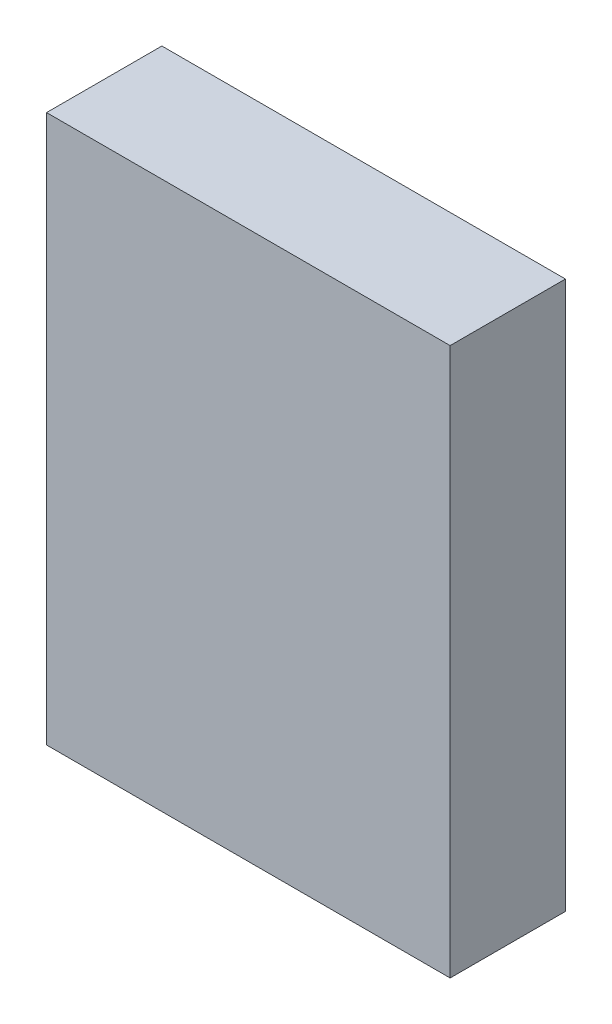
from build123d import *

# Parameters (mm, degrees)
SKETCH1_W           = 35
SKETCH1_H           = 47.5
BOSS_EXTRUDE1_DEPTH = 10


with BuildPart() as part:
    # Sketch1 → Boss-Extrude1 (new body)
    with BuildSketch(Plane.XY):
        Rectangle(SKETCH1_W, SKETCH1_H)
    extrude(amount=BOSS_EXTRUDE1_DEPTH)


solid = part.part
